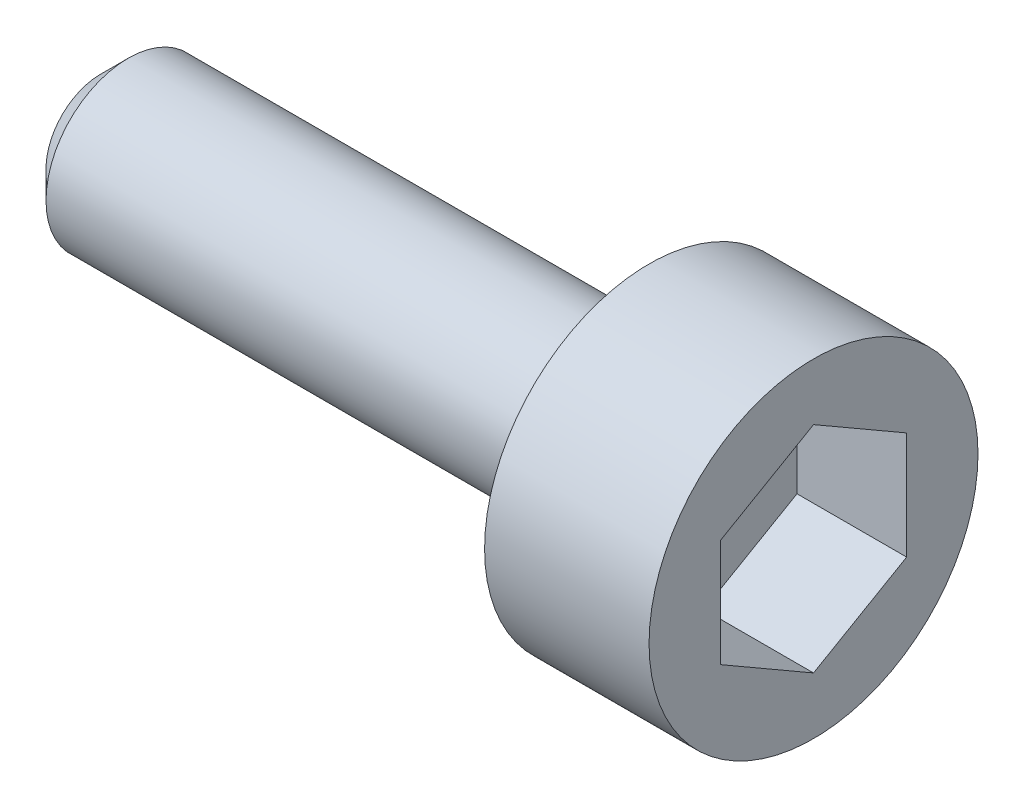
ISO-10303-21;
HEADER;
FILE_DESCRIPTION(('STEP AP214'),'2;1');
FILE_NAME('part.step','',(''),(''),'','','');
FILE_SCHEMA(('AUTOMOTIVE_DESIGN { 1 0 10303 214 1 1 1 1 }'));
ENDSEC;
DATA;
#1=APPLICATION_CONTEXT('core data for automotive mechanical design processes');
#2=APPLICATION_PROTOCOL_DEFINITION('international standard','automotive_design',2000,#1);
#3=PRODUCT_CONTEXT('',#1,'mechanical');
#4=PRODUCT('Part','Part','',(#3));
#5=PRODUCT_RELATED_PRODUCT_CATEGORY('part','',(#4));
#6=PRODUCT_DEFINITION_FORMATION('','',#4);
#7=PRODUCT_DEFINITION_CONTEXT('part definition',#1,'design');
#8=PRODUCT_DEFINITION('design','',#6,#7);
#9=PRODUCT_DEFINITION_SHAPE('','',#8);
#10=(LENGTH_UNIT() NAMED_UNIT(*) SI_UNIT(.MILLI.,.METRE.));
#11=(NAMED_UNIT(*) PLANE_ANGLE_UNIT() SI_UNIT($,.RADIAN.));
#12=(NAMED_UNIT(*) SI_UNIT($,.STERADIAN.) SOLID_ANGLE_UNIT());
#13=UNCERTAINTY_MEASURE_WITH_UNIT(LENGTH_MEASURE(1.E-05),#10,'distance_accuracy_value','');
#14=(GEOMETRIC_REPRESENTATION_CONTEXT(3) GLOBAL_UNCERTAINTY_ASSIGNED_CONTEXT((#13)) GLOBAL_UNIT_ASSIGNED_CONTEXT((#10,
#11,#12)) REPRESENTATION_CONTEXT('',''));
#15=CARTESIAN_POINT('',(0.,0.,0.));
#16=DIRECTION('',(0.,0.,1.));
#17=DIRECTION('',(1.,0.,0.));
#18=AXIS2_PLACEMENT_3D('',#15,#16,#17);
#19=CARTESIAN_POINT('',(13.,3.,0.));
#20=DIRECTION('',(-1.,0.,0.));
#21=DIRECTION('',(0.,0.,0.999999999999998));
#22=AXIS2_PLACEMENT_3D('',#19,#20,#21);
#23=PLANE('',#22);
#24=DIRECTION('',(0.,0.5,-0.866025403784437));
#25=VECTOR('',#24,1.);
#26=CARTESIAN_POINT('',(13.,-1.96134856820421,0.));
#27=LINE('',#26,#25);
#28=CARTESIAN_POINT('',(13.,-1.96134856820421,0.));
#29=VERTEX_POINT('',#28);
#30=CARTESIAN_POINT('',(13.,-0.980674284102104,-1.69857768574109));
#31=VERTEX_POINT('',#30);
#32=EDGE_CURVE('E115',#29,#31,#27,.T.);
#33=ORIENTED_EDGE('',*,*,#32,.F.);
#34=DIRECTION('',(0.,-0.499999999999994,-0.86602540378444));
#35=VECTOR('',#34,1.);
#36=CARTESIAN_POINT('',(13.,-0.980674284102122,1.69857768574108));
#37=LINE('',#36,#35);
#38=CARTESIAN_POINT('',(13.,-0.980674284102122,1.69857768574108));
#39=VERTEX_POINT('',#38);
#40=EDGE_CURVE('E61',#39,#29,#37,.T.);
#41=ORIENTED_EDGE('',*,*,#40,.F.);
#42=DIRECTION('',(0.,-0.999999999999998,0.));
#43=VECTOR('',#42,1.);
#44=CARTESIAN_POINT('',(13.,0.980674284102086,1.69857768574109));
#45=LINE('',#44,#43);
#46=CARTESIAN_POINT('',(13.,0.980674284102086,1.69857768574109));
#47=VERTEX_POINT('',#46);
#48=EDGE_CURVE('E130',#47,#39,#45,.T.);
#49=ORIENTED_EDGE('',*,*,#48,.F.);
#50=DIRECTION('',(0.,-0.500000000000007,0.866025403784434));
#51=VECTOR('',#50,1.);
#52=CARTESIAN_POINT('',(13.,1.96134856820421,0.));
#53=LINE('',#52,#51);
#54=CARTESIAN_POINT('',(13.,1.96134856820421,0.));
#55=VERTEX_POINT('',#54);
#56=EDGE_CURVE('E124',#55,#47,#53,.T.);
#57=ORIENTED_EDGE('',*,*,#56,.F.);
#58=DIRECTION('',(0.,0.499999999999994,0.86602540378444));
#59=VECTOR('',#58,1.);
#60=CARTESIAN_POINT('',(13.,0.980674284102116,-1.69857768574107));
#61=LINE('',#60,#59);
#62=CARTESIAN_POINT('',(13.,0.980674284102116,-1.69857768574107));
#63=VERTEX_POINT('',#62);
#64=EDGE_CURVE('E122',#63,#55,#61,.T.);
#65=ORIENTED_EDGE('',*,*,#64,.F.);
#66=DIRECTION('',(0.,0.999999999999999,0.));
#67=VECTOR('',#66,1.);
#68=CARTESIAN_POINT('',(13.,-0.980674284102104,-1.69857768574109));
#69=LINE('',#68,#67);
#70=EDGE_CURVE('E104',#31,#63,#69,.T.);
#71=ORIENTED_EDGE('',*,*,#70,.F.);
#72=EDGE_LOOP('',(#33,#41,#49,#57,#65,#71));
#73=FACE_BOUND('',#72,.T.);
#74=CARTESIAN_POINT('',(13.,0.,0.));
#75=DIRECTION('',(-1.,0.,0.));
#76=DIRECTION('',(0.,0.,0.999999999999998));
#77=AXIS2_PLACEMENT_3D('',#74,#75,#76);
#78=CIRCLE('',#77,3.);
#79=CARTESIAN_POINT('',(13.,0.,3.));
#80=VERTEX_POINT('',#79);
#81=EDGE_CURVE('E160',#80,#80,#78,.T.);
#82=ORIENTED_EDGE('',*,*,#81,.F.);
#83=EDGE_LOOP('',(#82));
#84=FACE_BOUND('',#83,.T.);
#85=ADVANCED_FACE('F47',(#73,#84),#23,.F.);
#86=CARTESIAN_POINT('',(-28.3117665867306,0.,0.));
#87=DIRECTION('',(-1.,0.,0.));
#88=DIRECTION('',(0.,0.,0.999999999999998));
#89=AXIS2_PLACEMENT_3D('',#86,#87,#88);
#90=CYLINDRICAL_SURFACE('',#89,3.);
#91=CARTESIAN_POINT('',(10.,0.,0.));
#92=DIRECTION('',(-1.,0.,0.));
#93=DIRECTION('',(0.,0.,0.999999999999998));
#94=AXIS2_PLACEMENT_3D('',#91,#92,#93);
#95=CIRCLE('',#94,3.);
#96=CARTESIAN_POINT('',(10.,0.,3.));
#97=VERTEX_POINT('',#96);
#98=EDGE_CURVE('E157',#97,#97,#95,.T.);
#99=ORIENTED_EDGE('',*,*,#98,.F.);
#100=EDGE_LOOP('',(#99));
#101=FACE_BOUND('',#100,.T.);
#102=ORIENTED_EDGE('',*,*,#81,.T.);
#103=EDGE_LOOP('',(#102));
#104=FACE_BOUND('',#103,.T.);
#105=ADVANCED_FACE('F182',(#101,#104),#90,.T.);
#106=CARTESIAN_POINT('',(10.,1.5,0.));
#107=DIRECTION('',(1.,0.,0.));
#108=DIRECTION('',(0.,0.,-0.999999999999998));
#109=AXIS2_PLACEMENT_3D('',#106,#107,#108);
#110=PLANE('',#109);
#111=CARTESIAN_POINT('',(10.,0.,0.));
#112=DIRECTION('',(-1.,0.,0.));
#113=DIRECTION('',(0.,0.,0.999999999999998));
#114=AXIS2_PLACEMENT_3D('',#111,#112,#113);
#115=CIRCLE('',#114,1.5);
#116=CARTESIAN_POINT('',(10.,0.,1.5));
#117=VERTEX_POINT('',#116);
#118=EDGE_CURVE('E148',#117,#117,#115,.T.);
#119=ORIENTED_EDGE('',*,*,#118,.F.);
#120=EDGE_LOOP('',(#119));
#121=FACE_BOUND('',#120,.T.);
#122=ORIENTED_EDGE('',*,*,#98,.T.);
#123=EDGE_LOOP('',(#122));
#124=FACE_BOUND('',#123,.T.);
#125=ADVANCED_FACE('F186',(#121,#124),#110,.F.);
#126=CARTESIAN_POINT('',(-28.3117665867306,0.,0.));
#127=DIRECTION('',(-1.,0.,0.));
#128=DIRECTION('',(0.,0.,0.999999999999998));
#129=AXIS2_PLACEMENT_3D('',#126,#127,#128);
#130=CYLINDRICAL_SURFACE('',#129,1.5);
#131=CARTESIAN_POINT('',(0.500000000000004,0.,0.));
#132=DIRECTION('',(1.,0.,0.));
#133=DIRECTION('',(0.,0.,-0.999999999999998));
#134=AXIS2_PLACEMENT_3D('',#131,#132,#133);
#135=CIRCLE('',#134,1.5);
#136=CARTESIAN_POINT('',(0.500000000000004,0.,-1.5));
#137=VERTEX_POINT('',#136);
#138=EDGE_CURVE('E13',#137,#137,#135,.T.);
#139=ORIENTED_EDGE('',*,*,#138,.T.);
#140=EDGE_LOOP('',(#139));
#141=FACE_BOUND('',#140,.T.);
#142=ORIENTED_EDGE('',*,*,#118,.T.);
#143=EDGE_LOOP('',(#142));
#144=FACE_BOUND('',#143,.T.);
#145=ADVANCED_FACE('F178',(#141,#144),#130,.T.);
#146=CARTESIAN_POINT('',(0.,0.,0.));
#147=DIRECTION('',(1.,0.,0.));
#148=DIRECTION('',(0.,0.,-0.999999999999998));
#149=AXIS2_PLACEMENT_3D('',#146,#147,#148);
#150=PLANE('',#149);
#151=CARTESIAN_POINT('',(0.,0.,0.));
#152=DIRECTION('',(1.,0.,0.));
#153=DIRECTION('',(0.,0.,-0.999999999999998));
#154=AXIS2_PLACEMENT_3D('',#151,#152,#153);
#155=CIRCLE('',#154,0.999999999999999);
#156=CARTESIAN_POINT('',(0.,0.,-0.999999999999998));
#157=VERTEX_POINT('',#156);
#158=EDGE_CURVE('E54',#157,#157,#155,.F.);
#159=ORIENTED_EDGE('',*,*,#158,.T.);
#160=EDGE_LOOP('',(#159));
#161=FACE_BOUND('',#160,.T.);
#162=ADVANCED_FACE('F165',(#161),#150,.F.);
#163=CARTESIAN_POINT('',(0.,0.,0.));
#164=DIRECTION('',(1.,0.,0.));
#165=DIRECTION('',(0.,0.,-0.999999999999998));
#166=AXIS2_PLACEMENT_3D('',#163,#164,#165);
#167=CONICAL_SURFACE('',#166,0.999999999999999,0.785398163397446);
#168=ORIENTED_EDGE('',*,*,#138,.F.);
#169=EDGE_LOOP('',(#168));
#170=FACE_BOUND('',#169,.T.);
#171=ORIENTED_EDGE('',*,*,#158,.F.);
#172=EDGE_LOOP('',(#171));
#173=FACE_BOUND('',#172,.T.);
#174=ADVANCED_FACE('F167',(#170,#173),#167,.T.);
#175=CARTESIAN_POINT('',(11.,-0.980674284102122,1.69857768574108));
#176=DIRECTION('',(0.,-0.86602540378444,0.499999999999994));
#177=DIRECTION('',(0.,-0.499999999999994,-0.866025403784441));
#178=AXIS2_PLACEMENT_3D('',#175,#176,#177);
#179=PLANE('',#178);
#180=ORIENTED_EDGE('',*,*,#40,.T.);
#181=DIRECTION('',(1.,0.,0.));
#182=VECTOR('',#181,1.);
#183=CARTESIAN_POINT('',(11.,-1.96134856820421,0.));
#184=LINE('',#183,#182);
#185=CARTESIAN_POINT('',(11.,-1.96134856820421,0.));
#186=VERTEX_POINT('',#185);
#187=EDGE_CURVE('E112',#186,#29,#184,.T.);
#188=ORIENTED_EDGE('',*,*,#187,.F.);
#189=DIRECTION('',(0.,-0.499999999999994,-0.86602540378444));
#190=VECTOR('',#189,1.);
#191=CARTESIAN_POINT('',(11.,-0.980674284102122,1.69857768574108));
#192=LINE('',#191,#190);
#193=CARTESIAN_POINT('',(11.,-0.980674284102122,1.69857768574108));
#194=VERTEX_POINT('',#193);
#195=EDGE_CURVE('E132',#194,#186,#192,.T.);
#196=ORIENTED_EDGE('',*,*,#195,.F.);
#197=DIRECTION('',(1.,0.,0.));
#198=VECTOR('',#197,1.);
#199=CARTESIAN_POINT('',(11.,-0.980674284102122,1.69857768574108));
#200=LINE('',#199,#198);
#201=EDGE_CURVE('E68',#194,#39,#200,.T.);
#202=ORIENTED_EDGE('',*,*,#201,.T.);
#203=EDGE_LOOP('',(#180,#188,#196,#202));
#204=FACE_BOUND('',#203,.T.);
#205=ADVANCED_FACE('F169',(#204),#179,.F.);
#206=CARTESIAN_POINT('',(11.,0.980674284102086,1.69857768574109));
#207=DIRECTION('',(0.,0.,0.999999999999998));
#208=DIRECTION('',(0.,-0.999999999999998,0.));
#209=AXIS2_PLACEMENT_3D('',#206,#207,#208);
#210=PLANE('',#209);
#211=ORIENTED_EDGE('',*,*,#48,.T.);
#212=ORIENTED_EDGE('',*,*,#201,.F.);
#213=DIRECTION('',(0.,-0.999999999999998,0.));
#214=VECTOR('',#213,1.);
#215=CARTESIAN_POINT('',(11.,0.980674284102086,1.69857768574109));
#216=LINE('',#215,#214);
#217=CARTESIAN_POINT('',(11.,0.980674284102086,1.69857768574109));
#218=VERTEX_POINT('',#217);
#219=EDGE_CURVE('E144',#218,#194,#216,.T.);
#220=ORIENTED_EDGE('',*,*,#219,.F.);
#221=DIRECTION('',(1.,0.,0.));
#222=VECTOR('',#221,1.);
#223=CARTESIAN_POINT('',(11.,0.980674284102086,1.69857768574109));
#224=LINE('',#223,#222);
#225=EDGE_CURVE('E149',#218,#47,#224,.T.);
#226=ORIENTED_EDGE('',*,*,#225,.T.);
#227=EDGE_LOOP('',(#211,#212,#220,#226));
#228=FACE_BOUND('',#227,.T.);
#229=ADVANCED_FACE('F176',(#228),#210,.F.);
#230=CARTESIAN_POINT('',(11.,1.96134856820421,0.));
#231=DIRECTION('',(0.,0.866025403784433,0.500000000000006));
#232=DIRECTION('',(0.,-0.500000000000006,0.866025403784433));
#233=AXIS2_PLACEMENT_3D('',#230,#231,#232);
#234=PLANE('',#233);
#235=ORIENTED_EDGE('',*,*,#56,.T.);
#236=ORIENTED_EDGE('',*,*,#225,.F.);
#237=DIRECTION('',(0.,-0.500000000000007,0.866025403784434));
#238=VECTOR('',#237,1.);
#239=CARTESIAN_POINT('',(11.,1.96134856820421,0.));
#240=LINE('',#239,#238);
#241=CARTESIAN_POINT('',(11.,1.96134856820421,0.));
#242=VERTEX_POINT('',#241);
#243=EDGE_CURVE('E141',#242,#218,#240,.T.);
#244=ORIENTED_EDGE('',*,*,#243,.F.);
#245=DIRECTION('',(1.,0.,0.));
#246=VECTOR('',#245,1.);
#247=CARTESIAN_POINT('',(11.,1.96134856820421,0.));
#248=LINE('',#247,#246);
#249=EDGE_CURVE('E151',#242,#55,#248,.T.);
#250=ORIENTED_EDGE('',*,*,#249,.T.);
#251=EDGE_LOOP('',(#235,#236,#244,#250));
#252=FACE_BOUND('',#251,.T.);
#253=ADVANCED_FACE('F222',(#252),#234,.F.);
#254=CARTESIAN_POINT('',(11.,0.980674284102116,-1.69857768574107));
#255=DIRECTION('',(0.,0.86602540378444,-0.499999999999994));
#256=DIRECTION('',(0.,0.499999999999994,0.86602540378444));
#257=AXIS2_PLACEMENT_3D('',#254,#255,#256);
#258=PLANE('',#257);
#259=ORIENTED_EDGE('',*,*,#64,.T.);
#260=ORIENTED_EDGE('',*,*,#249,.F.);
#261=DIRECTION('',(0.,0.499999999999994,0.86602540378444));
#262=VECTOR('',#261,1.);
#263=CARTESIAN_POINT('',(11.,0.980674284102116,-1.69857768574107));
#264=LINE('',#263,#262);
#265=CARTESIAN_POINT('',(11.,0.980674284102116,-1.69857768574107));
#266=VERTEX_POINT('',#265);
#267=EDGE_CURVE('E138',#266,#242,#264,.T.);
#268=ORIENTED_EDGE('',*,*,#267,.F.);
#269=DIRECTION('',(1.,0.,0.));
#270=VECTOR('',#269,1.);
#271=CARTESIAN_POINT('',(11.,0.980674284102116,-1.69857768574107));
#272=LINE('',#271,#270);
#273=EDGE_CURVE('E111',#266,#63,#272,.T.);
#274=ORIENTED_EDGE('',*,*,#273,.T.);
#275=EDGE_LOOP('',(#259,#260,#268,#274));
#276=FACE_BOUND('',#275,.T.);
#277=ADVANCED_FACE('F229',(#276),#258,.F.);
#278=CARTESIAN_POINT('',(11.,-0.980674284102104,-1.69857768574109));
#279=DIRECTION('',(0.,0.,-0.999999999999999));
#280=DIRECTION('',(0.,0.999999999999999,0.));
#281=AXIS2_PLACEMENT_3D('',#278,#279,#280);
#282=PLANE('',#281);
#283=ORIENTED_EDGE('',*,*,#70,.T.);
#284=ORIENTED_EDGE('',*,*,#273,.F.);
#285=DIRECTION('',(0.,0.999999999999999,0.));
#286=VECTOR('',#285,1.);
#287=CARTESIAN_POINT('',(11.,-0.980674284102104,-1.69857768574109));
#288=LINE('',#287,#286);
#289=CARTESIAN_POINT('',(11.,-0.980674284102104,-1.69857768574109));
#290=VERTEX_POINT('',#289);
#291=EDGE_CURVE('E107',#290,#266,#288,.T.);
#292=ORIENTED_EDGE('',*,*,#291,.F.);
#293=DIRECTION('',(1.,0.,0.));
#294=VECTOR('',#293,1.);
#295=CARTESIAN_POINT('',(11.,-0.980674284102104,-1.69857768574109));
#296=LINE('',#295,#294);
#297=EDGE_CURVE('E100',#290,#31,#296,.T.);
#298=ORIENTED_EDGE('',*,*,#297,.T.);
#299=EDGE_LOOP('',(#283,#284,#292,#298));
#300=FACE_BOUND('',#299,.T.);
#301=ADVANCED_FACE('F102',(#300),#282,.F.);
#302=CARTESIAN_POINT('',(11.,-1.96134856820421,0.));
#303=DIRECTION('',(0.,-0.866025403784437,-0.5));
#304=DIRECTION('',(0.,0.5,-0.866025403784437));
#305=AXIS2_PLACEMENT_3D('',#302,#303,#304);
#306=PLANE('',#305);
#307=ORIENTED_EDGE('',*,*,#32,.T.);
#308=ORIENTED_EDGE('',*,*,#297,.F.);
#309=DIRECTION('',(0.,0.5,-0.866025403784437));
#310=VECTOR('',#309,1.);
#311=CARTESIAN_POINT('',(11.,-1.96134856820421,0.));
#312=LINE('',#311,#310);
#313=EDGE_CURVE('E135',#186,#290,#312,.T.);
#314=ORIENTED_EDGE('',*,*,#313,.F.);
#315=ORIENTED_EDGE('',*,*,#187,.T.);
#316=EDGE_LOOP('',(#307,#308,#314,#315));
#317=FACE_BOUND('',#316,.T.);
#318=ADVANCED_FACE('F116',(#317),#306,.F.);
#319=CARTESIAN_POINT('',(11.,-2.94202285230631,-1.69857768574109));
#320=DIRECTION('',(1.,0.,0.));
#321=DIRECTION('',(0.,0.,-0.999999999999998));
#322=AXIS2_PLACEMENT_3D('',#319,#320,#321);
#323=PLANE('',#322);
#324=ORIENTED_EDGE('',*,*,#195,.T.);
#325=ORIENTED_EDGE('',*,*,#313,.T.);
#326=ORIENTED_EDGE('',*,*,#291,.T.);
#327=ORIENTED_EDGE('',*,*,#267,.T.);
#328=ORIENTED_EDGE('',*,*,#243,.T.);
#329=ORIENTED_EDGE('',*,*,#219,.T.);
#330=EDGE_LOOP('',(#324,#325,#326,#327,#328,#329));
#331=FACE_BOUND('',#330,.T.);
#332=ADVANCED_FACE('F250',(#331),#323,.T.);
#333=CLOSED_SHELL('',(#85,#105,#125,#145,#162,#174,#205,#229,#253,#277,#301,#318,#332));
#334=MANIFOLD_SOLID_BREP('B2',#333);
#335=ADVANCED_BREP_SHAPE_REPRESENTATION('',(#18,#334),#14);
#336=SHAPE_DEFINITION_REPRESENTATION(#9,#335);
ENDSEC;
END-ISO-10303-21;
